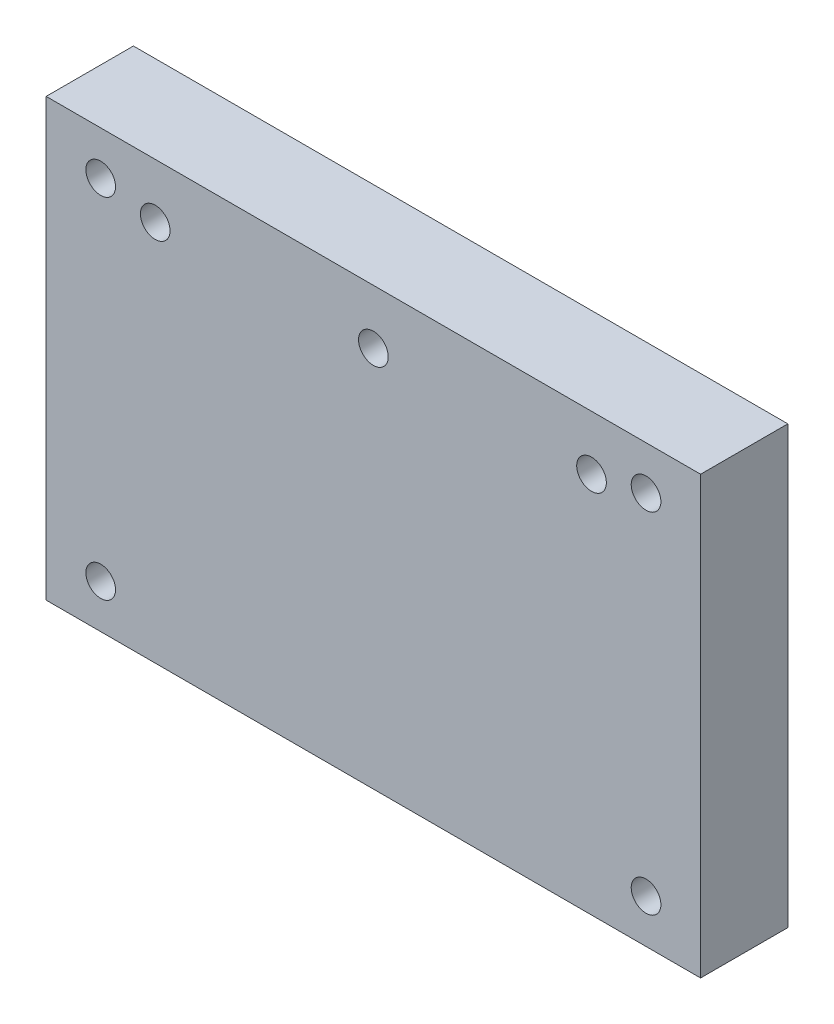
from build123d import *

# Parameters (mm, degrees)
ESQUISSE1_W            = 150
ESQUISSE1_H            = 100
EXTRUSION1_DEPTH       = 20
TROU_TARAUD_M8X1_251_D = 6.8
TROU_TARAUD_M81_D      = 6.8


with BuildPart() as part:
    # Esquisse1 → Extrusion1 (new body)
    with BuildSketch(Plane.XY):
        with Locations((75, 0)):
            Rectangle(ESQUISSE1_W, ESQUISSE1_H)
    extrude(amount=EXTRUSION1_DEPTH)

    # Trou taraud_ M8x1.251 (through all)
    with Locations(Plane.XY.offset(20)):
        with Locations((12.5, 40), (137.5, 40), (137.5, -40), (12.5, -40)):
            Hole(TROU_TARAUD_M8X1_251_D / 2)

    # Trou taraud_ M81 (through all)
    with Locations(Plane.XY.offset(20)):
        with Locations((75, 37.5), (125, 37.5), (25, 37.5)):
            Hole(TROU_TARAUD_M81_D / 2)


solid = part.part
